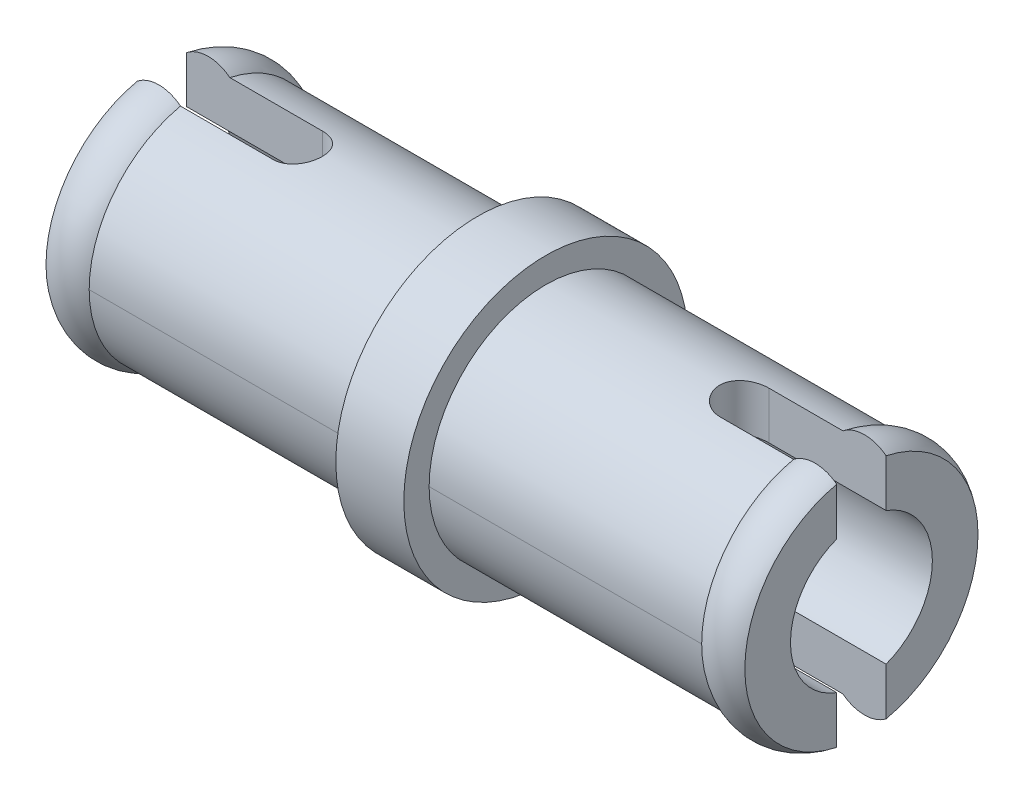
from build123d import *

# Parameters (mm, degrees)
SKETCH1_R           = 2.4
BASE_EXTRUDE_DEPTH  = 6.5
SKETCH3_R           = 2.921
BOSS_EXTRUDE1_DEPTH = 1.4
SKETCH4_R           = 2.3876
BOSS_EXTRUDE2_DEPTH = 6.5
SKETCH7_R           = 1.4605
CUT_EXTRUDE2_DEPTH  = 15.98080388
CUT_EXTRUDE4_DEPTH  = 9.914846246


with BuildPart() as part:
    # Sketch1 → Base-Extrude (new body)
    with BuildSketch(Plane(origin=(0, 0, 0), x_dir=(0, 0, -1), z_dir=(1, 0, 0))):
        with Locations(Location((0, 0, 0), (0, 0, 180))):
            Circle(SKETCH1_R)
    extrude(amount=BASE_EXTRUDE_DEPTH)

    # Sketch3 → Boss-Extrude1 (add)
    with BuildSketch(Plane.ZY):
        Circle(SKETCH3_R)
    extrude(amount=BOSS_EXTRUDE1_DEPTH)

    # Sketch4 → Boss-Extrude2 (add)
    with BuildSketch(Plane.ZY.offset(1.4)):
        with Locations(Location((0, 0, 0), (0, 0, 180))):
            Circle(SKETCH4_R)
    extrude(amount=BOSS_EXTRUDE2_DEPTH)

    # Sketch6 → Boss-Revolve2 (revolve)
    with BuildSketch(Plane(origin=(0, 0, 0), x_dir=(1, 0, 0), z_dir=(0, 1, 0)), mode=Mode.PRIVATE) as boss_revolve2_sk:
        with BuildLine():
            Line((-7.9, 2.3876), (-7.011, 2.3876))
            ThreePointArc((-7.011, 2.3876), (-7.4555, 2.54), (-7.9, 2.3876))
        make_face()
    revolve(boss_revolve2_sk.sketch.rotate(Axis((0, 0, 0), (-1, 0, 0)), 180), axis=Axis((0, 0, 0), (-1, 0, 0)))

    # Sketch9 → Boss-Revolve3 (revolve)
    with BuildSketch(Plane(origin=(0, 0, 0), x_dir=(1, 0, 0), z_dir=(0, 1, 0)), mode=Mode.PRIVATE) as boss_revolve3_sk:
        with BuildLine():
            Line((5.611, 2.4), (6.5, 2.4))
            ThreePointArc((6.5, 2.4), (6.0555, 2.549830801), (5.611, 2.4))
        make_face()
    revolve(boss_revolve3_sk.sketch.rotate(Axis((0, 0, 0), (1, 0, 0)), 180), axis=Axis((0, 0, 0), (1, 0, 0)))

    # Sketch7 → Cut-Extrude2 (cut, through all)
    with BuildSketch(Plane.ZY.offset(7.9)):
        Circle(SKETCH7_R)
    extrude(amount=-CUT_EXTRUDE2_DEPTH, mode=Mode.SUBTRACT)

    # Sketch8 → Cut-Extrude4 (cut, symmetric)
    with BuildSketch(Plane(origin=(0, 0, 0), x_dir=(1, 0, 0), z_dir=(0, 1, 0))):
        with BuildLine():
            Line((-7.9, 0.508), (-5.106, 0.508))
            ThreePointArc((-5.106, 0.508), (-4.598, 0), (-5.106, -0.508))
            Line((-5.106, -0.508), (-7.9, -0.508))
            Line((-7.9, -0.508), (-7.9, 0.508))
        make_face()
    cut_extrude4 = extrude(amount=CUT_EXTRUDE4_DEPTH, both=True, mode=Mode.SUBTRACT)

    # Mirror7: Cut-Extrude4 across plane
    add(cut_extrude4.mirror(Plane(origin=(-0.508, 0, 0), x_dir=(0, 0, 1), z_dir=(1, 0, 0))), mode=Mode.SUBTRACT)


solid = part.part
